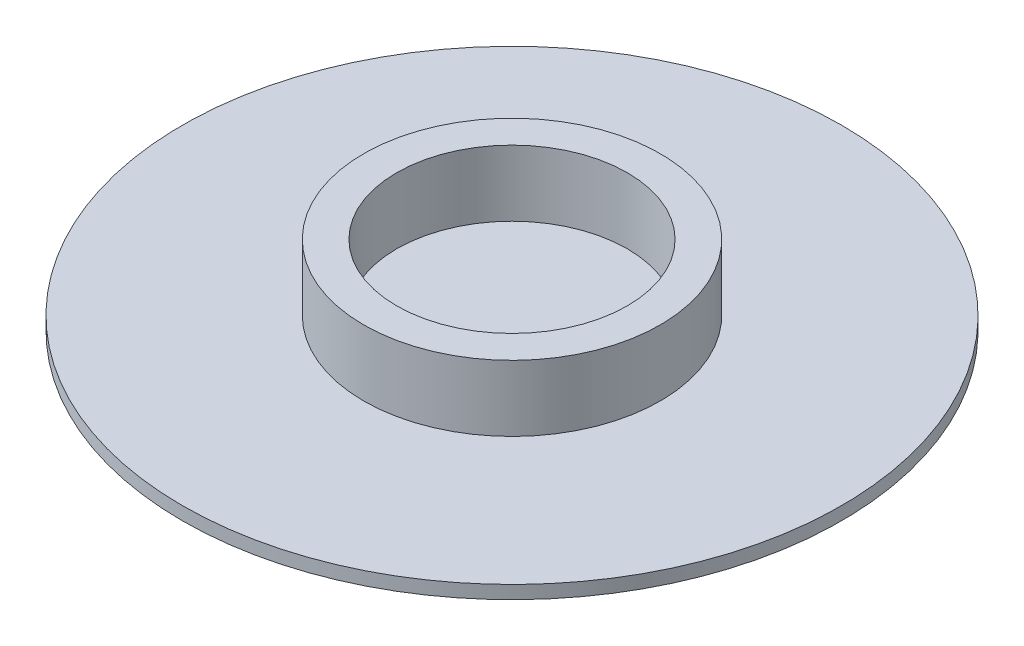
ISO-10303-21;
HEADER;
FILE_DESCRIPTION(('STEP AP214'),'2;1');
FILE_NAME('part.step','',(''),(''),'','','');
FILE_SCHEMA(('AUTOMOTIVE_DESIGN { 1 0 10303 214 1 1 1 1 }'));
ENDSEC;
DATA;
#1=APPLICATION_CONTEXT('core data for automotive mechanical design processes');
#2=APPLICATION_PROTOCOL_DEFINITION('international standard','automotive_design',2000,#1);
#3=PRODUCT_CONTEXT('',#1,'mechanical');
#4=PRODUCT('Part','Part','',(#3));
#5=PRODUCT_RELATED_PRODUCT_CATEGORY('part','',(#4));
#6=PRODUCT_DEFINITION_FORMATION('','',#4);
#7=PRODUCT_DEFINITION_CONTEXT('part definition',#1,'design');
#8=PRODUCT_DEFINITION('design','',#6,#7);
#9=PRODUCT_DEFINITION_SHAPE('','',#8);
#10=(LENGTH_UNIT() NAMED_UNIT(*) SI_UNIT(.MILLI.,.METRE.));
#11=(NAMED_UNIT(*) PLANE_ANGLE_UNIT() SI_UNIT($,.RADIAN.));
#12=(NAMED_UNIT(*) SI_UNIT($,.STERADIAN.) SOLID_ANGLE_UNIT());
#13=UNCERTAINTY_MEASURE_WITH_UNIT(LENGTH_MEASURE(1.E-05),#10,'distance_accuracy_value','');
#14=(GEOMETRIC_REPRESENTATION_CONTEXT(3) GLOBAL_UNCERTAINTY_ASSIGNED_CONTEXT((#13)) GLOBAL_UNIT_ASSIGNED_CONTEXT((#10,
#11,#12)) REPRESENTATION_CONTEXT('',''));
#15=CARTESIAN_POINT('',(0.,0.,0.));
#16=DIRECTION('',(0.,0.,1.));
#17=DIRECTION('',(1.,0.,0.));
#18=AXIS2_PLACEMENT_3D('',#15,#16,#17);
#19=CARTESIAN_POINT('',(0.,2.54,0.));
#20=DIRECTION('',(0.,1.,0.));
#21=DIRECTION('',(0.,0.,1.));
#22=AXIS2_PLACEMENT_3D('',#19,#20,#21);
#23=PLANE('',#22);
#24=CARTESIAN_POINT('',(0.,2.54,0.));
#25=DIRECTION('',(0.,1.,0.));
#26=DIRECTION('',(0.,0.,1.));
#27=AXIS2_PLACEMENT_3D('',#24,#25,#26);
#28=CIRCLE('',#27,63.5);
#29=CARTESIAN_POINT('',(0.,2.54,63.5));
#30=VERTEX_POINT('',#29);
#31=EDGE_CURVE('E41',#30,#30,#28,.T.);
#32=ORIENTED_EDGE('',*,*,#31,.T.);
#33=EDGE_LOOP('',(#32));
#34=FACE_BOUND('',#33,.T.);
#35=CARTESIAN_POINT('',(0.,2.54,0.));
#36=DIRECTION('',(0.,1.,0.));
#37=DIRECTION('',(0.,0.,1.));
#38=AXIS2_PLACEMENT_3D('',#35,#36,#37);
#39=CIRCLE('',#38,28.575);
#40=CARTESIAN_POINT('',(0.,2.54,28.575));
#41=VERTEX_POINT('',#40);
#42=EDGE_CURVE('E52',#41,#41,#39,.T.);
#43=ORIENTED_EDGE('',*,*,#42,.F.);
#44=EDGE_LOOP('',(#43));
#45=FACE_BOUND('',#44,.T.);
#46=ADVANCED_FACE('F34',(#34,#45),#23,.T.);
#47=CARTESIAN_POINT('',(0.,2.54,0.));
#48=DIRECTION('',(0.,-1.,0.));
#49=DIRECTION('',(0.,0.,-1.));
#50=AXIS2_PLACEMENT_3D('',#47,#48,#49);
#51=CYLINDRICAL_SURFACE('',#50,63.5);
#52=ORIENTED_EDGE('',*,*,#31,.F.);
#53=EDGE_LOOP('',(#52));
#54=FACE_BOUND('',#53,.T.);
#55=CARTESIAN_POINT('',(0.,0.,0.));
#56=DIRECTION('',(0.,1.,0.));
#57=DIRECTION('',(0.,0.,1.));
#58=AXIS2_PLACEMENT_3D('',#55,#56,#57);
#59=CIRCLE('',#58,63.5);
#60=CARTESIAN_POINT('',(0.,0.,63.5));
#61=VERTEX_POINT('',#60);
#62=EDGE_CURVE('E45',#61,#61,#59,.T.);
#63=ORIENTED_EDGE('',*,*,#62,.T.);
#64=EDGE_LOOP('',(#63));
#65=FACE_BOUND('',#64,.T.);
#66=ADVANCED_FACE('F36',(#54,#65),#51,.T.);
#67=CARTESIAN_POINT('',(0.,0.,0.));
#68=DIRECTION('',(0.,1.,0.));
#69=DIRECTION('',(0.,0.,1.));
#70=AXIS2_PLACEMENT_3D('',#67,#68,#69);
#71=PLANE('',#70);
#72=ORIENTED_EDGE('',*,*,#62,.F.);
#73=EDGE_LOOP('',(#72));
#74=FACE_BOUND('',#73,.T.);
#75=ADVANCED_FACE('F66',(#74),#71,.F.);
#76=CARTESIAN_POINT('',(0.,15.24,0.));
#77=DIRECTION('',(0.,1.,0.));
#78=DIRECTION('',(0.,0.,1.));
#79=AXIS2_PLACEMENT_3D('',#76,#77,#78);
#80=PLANE('',#79);
#81=CARTESIAN_POINT('',(0.,15.24,0.));
#82=DIRECTION('',(0.,1.,0.));
#83=DIRECTION('',(0.,0.,1.));
#84=AXIS2_PLACEMENT_3D('',#81,#82,#83);
#85=CIRCLE('',#84,28.575);
#86=CARTESIAN_POINT('',(0.,15.24,28.575));
#87=VERTEX_POINT('',#86);
#88=EDGE_CURVE('E50',#87,#87,#85,.T.);
#89=ORIENTED_EDGE('',*,*,#88,.T.);
#90=EDGE_LOOP('',(#89));
#91=FACE_BOUND('',#90,.T.);
#92=CARTESIAN_POINT('',(0.,15.24,0.));
#93=DIRECTION('',(0.,1.,0.));
#94=DIRECTION('',(0.,0.,1.));
#95=AXIS2_PLACEMENT_3D('',#92,#93,#94);
#96=CIRCLE('',#95,22.225);
#97=CARTESIAN_POINT('',(0.,15.24,22.225));
#98=VERTEX_POINT('',#97);
#99=EDGE_CURVE('E55',#98,#98,#96,.T.);
#100=ORIENTED_EDGE('',*,*,#99,.F.);
#101=EDGE_LOOP('',(#100));
#102=FACE_BOUND('',#101,.T.);
#103=ADVANCED_FACE('F63',(#91,#102),#80,.T.);
#104=CARTESIAN_POINT('',(0.,15.24,0.));
#105=DIRECTION('',(0.,-1.,0.));
#106=DIRECTION('',(0.,0.,-1.));
#107=AXIS2_PLACEMENT_3D('',#104,#105,#106);
#108=CYLINDRICAL_SURFACE('',#107,28.575);
#109=ORIENTED_EDGE('',*,*,#88,.F.);
#110=EDGE_LOOP('',(#109));
#111=FACE_BOUND('',#110,.T.);
#112=ORIENTED_EDGE('',*,*,#42,.T.);
#113=EDGE_LOOP('',(#112));
#114=FACE_BOUND('',#113,.T.);
#115=ADVANCED_FACE('F65',(#111,#114),#108,.T.);
#116=CARTESIAN_POINT('',(0.,15.24,0.));
#117=DIRECTION('',(0.,-1.,0.));
#118=DIRECTION('',(0.,0.,-1.));
#119=AXIS2_PLACEMENT_3D('',#116,#117,#118);
#120=CYLINDRICAL_SURFACE('',#119,22.225);
#121=ORIENTED_EDGE('',*,*,#99,.T.);
#122=EDGE_LOOP('',(#121));
#123=FACE_BOUND('',#122,.T.);
#124=CARTESIAN_POINT('',(0.,2.54,0.));
#125=DIRECTION('',(0.,1.,0.));
#126=DIRECTION('',(0.,0.,1.));
#127=AXIS2_PLACEMENT_3D('',#124,#125,#126);
#128=CIRCLE('',#127,22.225);
#129=CARTESIAN_POINT('',(0.,2.54,22.225));
#130=VERTEX_POINT('',#129);
#131=EDGE_CURVE('E10',#130,#130,#128,.F.);
#132=ORIENTED_EDGE('',*,*,#131,.T.);
#133=EDGE_LOOP('',(#132));
#134=FACE_BOUND('',#133,.T.);
#135=ADVANCED_FACE('F61',(#123,#134),#120,.F.);
#136=ORIENTED_EDGE('',*,*,#131,.F.);
#137=EDGE_LOOP('',(#136));
#138=FACE_BOUND('',#137,.T.);
#139=ADVANCED_FACE('F79',(#138),#23,.T.);
#140=CLOSED_SHELL('',(#46,#66,#75,#103,#115,#135,#139));
#141=MANIFOLD_SOLID_BREP('B2',#140);
#142=ADVANCED_BREP_SHAPE_REPRESENTATION('',(#18,#141),#14);
#143=SHAPE_DEFINITION_REPRESENTATION(#9,#142);
ENDSEC;
END-ISO-10303-21;
